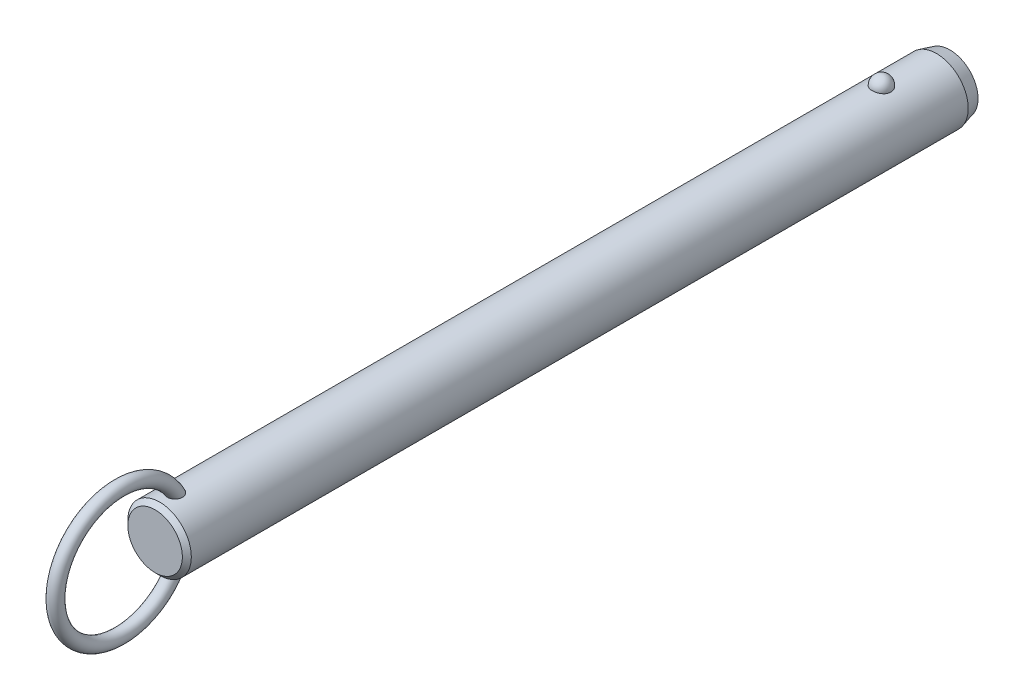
ISO-10303-21;
HEADER;
FILE_DESCRIPTION(('STEP AP214'),'2;1');
FILE_NAME('part.step','',(''),(''),'','','');
FILE_SCHEMA(('AUTOMOTIVE_DESIGN { 1 0 10303 214 1 1 1 1 }'));
ENDSEC;
DATA;
#1=APPLICATION_CONTEXT('core data for automotive mechanical design processes');
#2=APPLICATION_PROTOCOL_DEFINITION('international standard','automotive_design',2000,#1);
#3=PRODUCT_CONTEXT('',#1,'mechanical');
#4=PRODUCT('Part','Part','',(#3));
#5=PRODUCT_RELATED_PRODUCT_CATEGORY('part','',(#4));
#6=PRODUCT_DEFINITION_FORMATION('','',#4);
#7=PRODUCT_DEFINITION_CONTEXT('part definition',#1,'design');
#8=PRODUCT_DEFINITION('design','',#6,#7);
#9=PRODUCT_DEFINITION_SHAPE('','',#8);
#10=(LENGTH_UNIT() NAMED_UNIT(*) SI_UNIT(.MILLI.,.METRE.));
#11=(NAMED_UNIT(*) PLANE_ANGLE_UNIT() SI_UNIT($,.RADIAN.));
#12=(NAMED_UNIT(*) SI_UNIT($,.STERADIAN.) SOLID_ANGLE_UNIT());
#13=UNCERTAINTY_MEASURE_WITH_UNIT(LENGTH_MEASURE(1.E-05),#10,'distance_accuracy_value','');
#14=(GEOMETRIC_REPRESENTATION_CONTEXT(3) GLOBAL_UNCERTAINTY_ASSIGNED_CONTEXT((#13)) GLOBAL_UNIT_ASSIGNED_CONTEXT((#10,
#11,#12)) REPRESENTATION_CONTEXT('',''));
#15=CARTESIAN_POINT('',(0.,0.,0.));
#16=DIRECTION('',(0.,0.,1.));
#17=DIRECTION('',(1.,0.,0.));
#18=AXIS2_PLACEMENT_3D('',#15,#16,#17);
#19=CARTESIAN_POINT('',(0.,0.,152.4));
#20=DIRECTION('',(0.,0.,-1.));
#21=DIRECTION('',(-1.,0.,0.));
#22=AXIS2_PLACEMENT_3D('',#19,#20,#21);
#23=CYLINDRICAL_SURFACE('',#22,7.1);
#24=CARTESIAN_POINT('',(2.0769088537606,6.78943661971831,-2.10000000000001));
#25=CARTESIAN_POINT('',(2.07690739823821,6.78943796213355,-1.98268154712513));
#26=CARTESIAN_POINT('',(2.06738130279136,6.79237331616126,-1.86534506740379));
#27=CARTESIAN_POINT('',(2.0295040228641,6.8037853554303,-1.63400788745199));
#28=CARTESIAN_POINT('',(2.00114757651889,6.81226358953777,-1.52000812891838));
#29=CARTESIAN_POINT('',(1.92632025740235,6.83379798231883,-1.29863433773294));
#30=CARTESIAN_POINT('',(1.87985726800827,6.84685214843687,-1.19125744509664));
#31=CARTESIAN_POINT('',(1.76995205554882,6.87608091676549,-0.986046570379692));
#32=CARTESIAN_POINT('',(1.70650980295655,6.8922555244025,-0.888212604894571));
#33=CARTESIAN_POINT('',(1.56381192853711,6.92602930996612,-0.704242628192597));
#34=CARTESIAN_POINT('',(1.4844714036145,6.94363582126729,-0.618173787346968));
#35=CARTESIAN_POINT('',(1.31221746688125,6.97823658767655,-0.460740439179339));
#36=CARTESIAN_POINT('',(1.21930409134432,6.99523084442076,-0.389375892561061));
#37=CARTESIAN_POINT('',(1.02268781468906,7.02666176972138,-0.263547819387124));
#38=CARTESIAN_POINT('',(0.919020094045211,7.04110638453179,-0.209031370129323));
#39=CARTESIAN_POINT('',(0.703548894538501,7.06588726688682,-0.118163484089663));
#40=CARTESIAN_POINT('',(0.591746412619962,7.07622403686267,-0.0818098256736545));
#41=CARTESIAN_POINT('',(0.365557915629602,7.09147068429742,-0.0288711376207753));
#42=CARTESIAN_POINT('',(0.251267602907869,7.09648447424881,-0.011907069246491));
#43=CARTESIAN_POINT('',(0.0213499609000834,7.10089837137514,0.00304925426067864));
#44=CARTESIAN_POINT('',(-0.0942772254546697,7.10029907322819,0.00104351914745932));
#45=CARTESIAN_POINT('',(-0.3216515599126,7.09360829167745,-0.0216931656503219));
#46=CARTESIAN_POINT('',(-0.433431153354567,7.08760388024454,-0.0421272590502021));
#47=CARTESIAN_POINT('',(-0.651862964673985,7.07086131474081,-0.100729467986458));
#48=CARTESIAN_POINT('',(-0.758515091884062,7.06012307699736,-0.13889789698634));
#49=CARTESIAN_POINT('',(-0.964449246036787,7.03496097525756,-0.232213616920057));
#50=CARTESIAN_POINT('',(-1.06368095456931,7.02051445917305,-0.287465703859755));
#51=CARTESIAN_POINT('',(-1.25145353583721,6.98948740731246,-0.413383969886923));
#52=CARTESIAN_POINT('',(-1.33999321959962,6.97290663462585,-0.484051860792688));
#53=CARTESIAN_POINT('',(-1.50591604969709,6.93898770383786,-0.640594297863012));
#54=CARTESIAN_POINT('',(-1.58302488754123,6.92164094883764,-0.726757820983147));
#55=CARTESIAN_POINT('',(-1.72189320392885,6.8884103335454,-0.910927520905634));
#56=CARTESIAN_POINT('',(-1.78365144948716,6.87252659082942,-1.00893464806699));
#57=CARTESIAN_POINT('',(-1.89101272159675,6.84377189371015,-1.21549497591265));
#58=CARTESIAN_POINT('',(-1.93639553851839,6.83094274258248,-1.32416860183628));
#59=CARTESIAN_POINT('',(-2.00874275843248,6.81002070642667,-1.54791500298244));
#60=CARTESIAN_POINT('',(-2.03570774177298,6.80192767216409,-1.66298757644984));
#61=CARTESIAN_POINT('',(-2.07047276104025,6.7914266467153,-1.89571453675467));
#62=CARTESIAN_POINT('',(-2.07835878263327,6.78899315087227,-2.01335491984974));
#63=CARTESIAN_POINT('',(-2.07502083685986,6.79001409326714,-2.24833570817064));
#64=CARTESIAN_POINT('',(-2.06379746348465,6.7934683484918,-2.36567612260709));
#65=CARTESIAN_POINT('',(-2.02263913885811,6.80583442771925,-2.59603194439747));
#66=CARTESIAN_POINT('',(-1.99281127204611,6.81471501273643,-2.70906820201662));
#67=CARTESIAN_POINT('',(-1.91526639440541,6.83691232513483,-2.92836575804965));
#68=CARTESIAN_POINT('',(-1.8675486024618,6.85022924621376,-3.03462676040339));
#69=CARTESIAN_POINT('',(-1.75504492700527,6.87991336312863,-3.23806487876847));
#70=CARTESIAN_POINT('',(-1.69015924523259,6.89629822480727,-3.33518422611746));
#71=CARTESIAN_POINT('',(-1.54505404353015,6.93024852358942,-3.51697105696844));
#72=CARTESIAN_POINT('',(-1.46483385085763,6.94781401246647,-3.60163799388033));
#73=CARTESIAN_POINT('',(-1.29071406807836,6.98225977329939,-3.75654119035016));
#74=CARTESIAN_POINT('',(-1.19675650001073,6.99913673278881,-3.82671308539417));
#75=CARTESIAN_POINT('',(-0.997940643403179,7.03023618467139,-3.9501837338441));
#76=CARTESIAN_POINT('',(-0.893083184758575,7.04445887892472,-4.00348377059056));
#77=CARTESIAN_POINT('',(-0.676902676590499,7.06848365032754,-4.09107242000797));
#78=CARTESIAN_POINT('',(-0.565686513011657,7.0783430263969,-4.12560889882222));
#79=CARTESIAN_POINT('',(-0.338739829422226,7.09282534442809,-4.17575450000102));
#80=CARTESIAN_POINT('',(-0.2230099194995,7.09744899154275,-4.19136617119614));
#81=CARTESIAN_POINT('',(0.00707628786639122,7.10090930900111,-4.20307965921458));
#82=CARTESIAN_POINT('',(0.121410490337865,7.09986531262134,-4.19958377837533));
#83=CARTESIAN_POINT('',(0.34781544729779,7.092380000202,-4.17411564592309));
#84=CARTESIAN_POINT('',(0.459886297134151,7.08593891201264,-4.15214417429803));
#85=CARTESIAN_POINT('',(0.67808462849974,7.06838983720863,-4.09049562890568));
#86=CARTESIAN_POINT('',(0.784237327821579,7.05730369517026,-4.05090137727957));
#87=CARTESIAN_POINT('',(0.988305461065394,7.03163139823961,-3.95511447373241));
#88=CARTESIAN_POINT('',(1.08622031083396,7.01704499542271,-3.89892064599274));
#89=CARTESIAN_POINT('',(1.27284490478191,6.98562668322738,-3.77035541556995));
#90=CARTESIAN_POINT('',(1.36137372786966,6.96876135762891,-3.69772964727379));
#91=CARTESIAN_POINT('',(1.52509486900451,6.93477412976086,-3.53878279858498));
#92=CARTESIAN_POINT('',(1.60028496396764,6.91765218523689,-3.45245943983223));
#93=CARTESIAN_POINT('',(1.73681688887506,6.88465753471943,-3.26658774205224));
#94=CARTESIAN_POINT('',(1.79785966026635,6.86881574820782,-3.16681408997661));
#95=CARTESIAN_POINT('',(1.90265327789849,6.84053157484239,-2.95814408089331));
#96=CARTESIAN_POINT('',(1.94640861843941,6.82808830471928,-2.84925010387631));
#97=CARTESIAN_POINT('',(2.01274378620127,6.80881460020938,-2.63454318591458));
#98=CARTESIAN_POINT('',(2.03676193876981,6.80160856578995,-2.52920574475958));
#99=CARTESIAN_POINT('',(2.06884490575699,6.79191902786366,-2.3159172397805));
#100=CARTESIAN_POINT('',(2.07691019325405,6.78943538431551,-2.20796625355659));
#101=CARTESIAN_POINT('',(2.0769088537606,6.78943661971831,-2.10000000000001));
#102=B_SPLINE_CURVE_WITH_KNOTS('',3,(#24,#25,#26,#27,#28,#29,#30,#31,#32,#33,#34,#35,#36,#37,
#38,#39,#40,#41,#42,#43,#44,#45,#46,#47,#48,#49,#50,#51,#52,#53,#54,#55,#56,#57,#58,#59,#60,#61,
#62,#63,#64,#65,#66,#67,#68,#69,#70,#71,#72,#73,#74,#75,#76,#77,#78,#79,#80,#81,#82,#83,#84,#85,
#86,#87,#88,#89,#90,#91,#92,#93,#94,#95,#96,#97,#98,#99,#100,#101),.UNSPECIFIED.,.T.,.F.,(4,2,2,
2,2,2,2,2,2,2,2,2,2,2,2,2,2,2,2,2,2,2,2,2,2,2,2,2,2,2,2,2,2,2,2,2,2,2,4),(0.,0.351568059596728,
0.703234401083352,1.05474780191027,1.40626181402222,1.75970563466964,2.11314851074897,
2.46546960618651,2.81774759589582,3.16301449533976,3.50824481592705,3.84801136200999,
4.18778391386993,4.52968352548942,4.87162112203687,5.22076181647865,5.56993054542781,
5.92363364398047,6.27732559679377,6.62942052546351,6.98150450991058,7.33158042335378,
7.68167162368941,8.03384443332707,8.38603269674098,8.73975272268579,9.09344583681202,
9.44234545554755,9.79119807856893,10.1327344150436,10.4742563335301,10.8141898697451,
11.1541474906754,11.4997793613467,11.8454687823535,12.1979079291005,12.5502553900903,
12.8738073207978,13.1973496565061),.UNSPECIFIED.);
#103=CARTESIAN_POINT('',(2.0769088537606,6.78943661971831,-2.10000000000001));
#104=VERTEX_POINT('',#103);
#105=EDGE_CURVE('E41',#104,#104,#102,.T.);
#106=ORIENTED_EDGE('',*,*,#105,.T.);
#107=EDGE_LOOP('',(#106));
#108=FACE_BOUND('',#107,.T.);
#109=CARTESIAN_POINT('',(0.,0.,159.32));
#110=DIRECTION('',(0.,0.,1.));
#111=DIRECTION('',(1.,0.,0.));
#112=AXIS2_PLACEMENT_3D('',#109,#110,#111);
#113=CIRCLE('',#112,7.1);
#114=CARTESIAN_POINT('',(7.1,0.,159.32));
#115=VERTEX_POINT('',#114);
#116=EDGE_CURVE('E10',#115,#115,#113,.F.);
#117=ORIENTED_EDGE('',*,*,#116,.T.);
#118=EDGE_LOOP('',(#117));
#119=FACE_BOUND('',#118,.T.);
#120=CARTESIAN_POINT('',(-0.429539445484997,-7.08699541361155,154.142921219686));
#121=CARTESIAN_POINT('',(-0.508331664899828,-7.08221999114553,154.166876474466));
#122=CARTESIAN_POINT('',(-0.585039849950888,-7.07624016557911,154.197457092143));
#123=CARTESIAN_POINT('',(-0.73208265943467,-7.06254296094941,154.271024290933));
#124=CARTESIAN_POINT('',(-0.802417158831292,-7.05482554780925,154.314011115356));
#125=CARTESIAN_POINT('',(-0.934722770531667,-7.03851844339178,154.411113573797));
#126=CARTESIAN_POINT('',(-0.996700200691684,-7.02992941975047,154.465220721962));
#127=CARTESIAN_POINT('',(-1.11079942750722,-7.01280697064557,154.582967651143));
#128=CARTESIAN_POINT('',(-1.16292136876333,-7.00427354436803,154.646607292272));
#129=CARTESIAN_POINT('',(-1.25705660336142,-6.98799959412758,154.782687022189));
#130=CARTESIAN_POINT('',(-1.29888032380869,-6.98027525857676,154.855259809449));
#131=CARTESIAN_POINT('',(-1.37069920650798,-6.96652886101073,155.006168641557));
#132=CARTESIAN_POINT('',(-1.40069157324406,-6.96050720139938,155.084506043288));
#133=CARTESIAN_POINT('',(-1.45043507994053,-6.95031881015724,155.250190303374));
#134=CARTESIAN_POINT('',(-1.46937115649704,-6.94630231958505,155.337789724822));
#135=CARTESIAN_POINT('',(-1.49424917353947,-6.94099239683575,155.514871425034));
#136=CARTESIAN_POINT('',(-1.50018601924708,-6.93970003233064,155.604354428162));
#137=CARTESIAN_POINT('',(-1.49978214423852,-6.93978815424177,155.794060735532));
#138=CARTESIAN_POINT('',(-1.49187639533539,-6.94150934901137,155.894279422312));
#139=CARTESIAN_POINT('',(-1.46177925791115,-6.94790814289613,156.092479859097));
#140=CARTESIAN_POINT('',(-1.43957541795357,-6.95258831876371,156.190459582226));
#141=CARTESIAN_POINT('',(-1.37783293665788,-6.96510647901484,156.39536292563));
#142=CARTESIAN_POINT('',(-1.33634073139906,-6.97328848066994,156.501680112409));
#143=CARTESIAN_POINT('',(-1.23686994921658,-6.99161706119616,156.706177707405));
#144=CARTESIAN_POINT('',(-1.17889192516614,-7.00176357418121,156.804358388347));
#145=CARTESIAN_POINT('',(-1.05875124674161,-7.02082898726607,156.972374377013));
#146=CARTESIAN_POINT('',(-0.999247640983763,-7.02963746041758,157.044123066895));
#147=CARTESIAN_POINT('',(-0.869494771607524,-7.04686074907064,157.177195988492));
#148=CARTESIAN_POINT('',(-0.799263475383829,-7.05527619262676,157.238537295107));
#149=CARTESIAN_POINT('',(-0.665408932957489,-7.06899457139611,157.335131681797));
#150=CARTESIAN_POINT('',(-0.603817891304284,-7.07457275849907,157.373151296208));
#151=CARTESIAN_POINT('',(-0.475172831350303,-7.08437420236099,157.438758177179));
#152=CARTESIAN_POINT('',(-0.408123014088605,-7.08859848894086,157.466353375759));
#153=CARTESIAN_POINT('',(-0.26943193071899,-7.09522749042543,157.509256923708));
#154=CARTESIAN_POINT('',(-0.19775731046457,-7.09761688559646,157.524461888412));
#155=CARTESIAN_POINT('',(-0.0527849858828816,-7.10017268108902,157.540716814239));
#156=CARTESIAN_POINT('',(0.0205115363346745,-7.10034065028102,157.541776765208));
#157=CARTESIAN_POINT('',(0.156426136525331,-7.09855986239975,157.530461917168));
#158=CARTESIAN_POINT('',(0.219199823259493,-7.09688191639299,157.519806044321));
#159=CARTESIAN_POINT('',(0.342134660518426,-7.09201880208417,157.488537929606));
#160=CARTESIAN_POINT('',(0.40229529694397,-7.08883333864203,157.467923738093));
#161=CARTESIAN_POINT('',(0.520687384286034,-7.08113868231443,157.417212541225));
#162=CARTESIAN_POINT('',(0.578791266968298,-7.07658958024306,157.386827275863));
#163=CARTESIAN_POINT('',(0.69017323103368,-7.06659708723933,157.318367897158));
#164=CARTESIAN_POINT('',(0.743447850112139,-7.061153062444,157.280288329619));
#165=CARTESIAN_POINT('',(0.870947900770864,-7.04680292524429,157.176592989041));
#166=CARTESIAN_POINT('',(0.941828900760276,-7.03755800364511,157.106897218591));
#167=CARTESIAN_POINT('',(1.07136606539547,-7.01900793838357,156.956945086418));
#168=CARTESIAN_POINT('',(1.13000013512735,-7.00970271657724,156.876670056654));
#169=CARTESIAN_POINT('',(1.23579584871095,-6.99183327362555,156.706899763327));
#170=CARTESIAN_POINT('',(1.28274271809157,-6.98328455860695,156.617269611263));
#171=CARTESIAN_POINT('',(1.3635144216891,-6.96796352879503,156.432176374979));
#172=CARTESIAN_POINT('',(1.39733971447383,-6.96119115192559,156.336713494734));
#173=CARTESIAN_POINT('',(1.45579181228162,-6.94922464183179,156.12530928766));
#174=CARTESIAN_POINT('',(1.47790145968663,-6.94449000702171,156.008631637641));
#175=CARTESIAN_POINT('',(1.50168752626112,-6.93938731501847,155.773015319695));
#176=CARTESIAN_POINT('',(1.50336085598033,-6.93901991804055,155.65407631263));
#177=CARTESIAN_POINT('',(1.48486516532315,-6.9430010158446,155.42360799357));
#178=CARTESIAN_POINT('',(1.46573441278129,-6.9471253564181,155.311995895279));
#179=CARTESIAN_POINT('',(1.40606892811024,-6.95944667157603,155.094886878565));
#180=CARTESIAN_POINT('',(1.36556446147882,-6.96763788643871,154.9893815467));
#181=CARTESIAN_POINT('',(1.2708270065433,-6.98548038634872,154.804287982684));
#182=CARTESIAN_POINT('',(1.21949810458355,-6.99473841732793,154.723171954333));
#183=CARTESIAN_POINT('',(1.10242050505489,-7.0141406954,154.572227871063));
#184=CARTESIAN_POINT('',(1.03668119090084,-7.02428436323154,154.50239252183));
#185=CARTESIAN_POINT('',(0.900559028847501,-7.04295285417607,154.383573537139));
#186=CARTESIAN_POINT('',(0.831428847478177,-7.05153466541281,154.333157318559));
#187=CARTESIAN_POINT('',(0.685291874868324,-7.06723150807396,154.245142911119));
#188=CARTESIAN_POINT('',(0.608287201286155,-7.07434693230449,154.207541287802));
#189=CARTESIAN_POINT('',(0.451878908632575,-7.08602232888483,154.147491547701));
#190=CARTESIAN_POINT('',(0.372686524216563,-7.09067127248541,154.124508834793));
#191=CARTESIAN_POINT('',(0.211477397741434,-7.09730788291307,154.092035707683));
#192=CARTESIAN_POINT('',(0.129460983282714,-7.09929585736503,154.08254373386));
#193=CARTESIAN_POINT('',(-0.0332905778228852,-7.10037858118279,154.077351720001));
#194=CARTESIAN_POINT('',(-0.114016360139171,-7.09953334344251,154.081365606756));
#195=CARTESIAN_POINT('',(-0.273670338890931,-7.09517338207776,154.102454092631));
#196=CARTESIAN_POINT('',(-0.352598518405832,-7.09165863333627,154.119528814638));
#197=CARTESIAN_POINT('',(-0.429539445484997,-7.08699541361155,154.142921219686));
#198=B_SPLINE_CURVE_WITH_KNOTS('',3,(#120,#121,#122,#123,#124,#125,#126,#127,#128,#129,#130,
#131,#132,#133,#134,#135,#136,#137,#138,#139,#140,#141,#142,#143,#144,#145,#146,#147,#148,#149,
#150,#151,#152,#153,#154,#155,#156,#157,#158,#159,#160,#161,#162,#163,#164,#165,#166,#167,#168,
#169,#170,#171,#172,#173,#174,#175,#176,#177,#178,#179,#180,#181,#182,#183,#184,#185,#186,#187,
#188,#189,#190,#191,#192,#193,#194,#195,#196,#197),.UNSPECIFIED.,.T.,.F.,(4,2,2,2,2,2,2,2,2,2,2,
2,2,2,2,2,2,2,2,2,2,2,2,2,2,2,2,2,2,2,2,2,2,2,2,2,2,2,4),(0.,0.247183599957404,
0.494372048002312,0.741372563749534,0.988369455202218,1.23962059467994,1.490931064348,
1.75897818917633,2.02713035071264,2.3275826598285,2.62829697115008,2.97008736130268,
3.31186629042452,3.59175319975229,3.87117637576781,4.08813841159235,4.30493502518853,
4.5235225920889,4.74195577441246,4.93215328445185,5.12238804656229,5.31884850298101,
5.51544871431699,5.81332317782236,6.11173048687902,6.41527266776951,6.71880423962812,
7.07358156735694,7.42841252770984,7.76631485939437,8.10373999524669,8.39142246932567,
8.67891817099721,8.93560332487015,9.19221962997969,9.43881106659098,9.68537399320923,
9.92674752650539,10.1681233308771),.UNSPECIFIED.);
#199=CARTESIAN_POINT('',(-0.429539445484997,-7.08699541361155,154.142921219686));
#200=VERTEX_POINT('',#199);
#201=EDGE_CURVE('E59',#200,#200,#198,.T.);
#202=ORIENTED_EDGE('',*,*,#201,.T.);
#203=EDGE_LOOP('',(#202));
#204=FACE_BOUND('',#203,.T.);
#205=CARTESIAN_POINT('',(-0.429539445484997,7.08699541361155,154.142921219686));
#206=CARTESIAN_POINT('',(-0.351665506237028,7.09171429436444,154.119246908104));
#207=CARTESIAN_POINT('',(-0.271733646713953,7.09525896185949,154.102036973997));
#208=CARTESIAN_POINT('',(-0.110026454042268,7.09960839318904,154.081005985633));
#209=CARTESIAN_POINT('',(-0.0282502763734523,7.10041187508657,154.077191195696));
#210=CARTESIAN_POINT('',(0.134782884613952,7.09918849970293,154.083059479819));
#211=CARTESIAN_POINT('',(0.216039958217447,7.09716214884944,154.09274013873));
#212=CARTESIAN_POINT('',(0.375730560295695,7.09050177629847,154.125347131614));
#213=CARTESIAN_POINT('',(0.454164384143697,7.08586802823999,154.148272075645));
#214=CARTESIAN_POINT('',(0.606025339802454,7.07449911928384,154.206771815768));
#215=CARTESIAN_POINT('',(0.67945100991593,7.06776334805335,154.242350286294));
#216=CARTESIAN_POINT('',(0.819234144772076,7.05292866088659,154.325175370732));
#217=CARTESIAN_POINT('',(0.88559181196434,7.04482978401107,154.372421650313));
#218=CARTESIAN_POINT('',(1.00993211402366,7.02808709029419,154.477590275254));
#219=CARTESIAN_POINT('',(1.06785399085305,7.01943990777,154.535583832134));
#220=CARTESIAN_POINT('',(1.17342527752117,7.00256662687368,154.660301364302));
#221=CARTESIAN_POINT('',(1.22107408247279,6.99434055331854,154.727025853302));
#222=CARTESIAN_POINT('',(1.30652927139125,6.97889183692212,154.869362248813));
#223=CARTESIAN_POINT('',(1.34399711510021,6.97170674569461,154.945180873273));
#224=CARTESIAN_POINT('',(1.40682616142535,6.95930080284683,155.101810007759));
#225=CARTESIAN_POINT('',(1.43218374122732,6.95408053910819,155.18262200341));
#226=CARTESIAN_POINT('',(1.47246409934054,6.94566853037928,155.353531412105));
#227=CARTESIAN_POINT('',(1.48642590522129,6.9426653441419,155.44386307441));
#228=CARTESIAN_POINT('',(1.5011410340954,6.93949744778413,155.625619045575));
#229=CARTESIAN_POINT('',(1.50188917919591,6.93933385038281,155.717043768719));
#230=CARTESIAN_POINT('',(1.49030464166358,6.94183245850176,155.91084381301));
#231=CARTESIAN_POINT('',(1.47627413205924,6.94486147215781,156.013112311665));
#232=CARTESIAN_POINT('',(1.43356351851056,6.95380194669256,156.214471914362));
#233=CARTESIAN_POINT('',(1.4048676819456,6.95971650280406,156.313559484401));
#234=CARTESIAN_POINT('',(1.32908750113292,6.97461208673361,156.518908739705));
#235=CARTESIAN_POINT('',(1.28011435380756,6.98388945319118,156.624456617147));
#236=CARTESIAN_POINT('',(1.16520357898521,7.00397743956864,156.825760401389));
#237=CARTESIAN_POINT('',(1.09927694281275,7.01478706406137,156.921522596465));
#238=CARTESIAN_POINT('',(0.969361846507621,7.03373936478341,157.076756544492));
#239=CARTESIAN_POINT('',(0.909042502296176,7.04187023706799,157.139303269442));
#240=CARTESIAN_POINT('',(0.779178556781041,7.05741732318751,157.254053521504));
#241=CARTESIAN_POINT('',(0.709649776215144,7.06483472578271,157.306274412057));
#242=CARTESIAN_POINT('',(0.576854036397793,7.0767751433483,157.388113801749));
#243=CARTESIAN_POINT('',(0.515118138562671,7.08158033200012,157.420164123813));
#244=CARTESIAN_POINT('',(0.387127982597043,7.08972701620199,157.473765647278));
#245=CARTESIAN_POINT('',(0.320877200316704,7.09306962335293,157.495324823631));
#246=CARTESIAN_POINT('',(0.185041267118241,7.09791507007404,157.526400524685));
#247=CARTESIAN_POINT('',(0.115437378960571,7.09940591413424,157.535838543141));
#248=CARTESIAN_POINT('',(-0.0243157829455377,7.10030171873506,157.541522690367));
#249=CARTESIAN_POINT('',(-0.0944648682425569,7.0997073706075,157.537773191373));
#250=CARTESIAN_POINT('',(-0.225713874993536,7.09668414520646,157.518508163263));
#251=CARTESIAN_POINT('',(-0.287006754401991,7.09444865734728,157.504232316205));
#252=CARTESIAN_POINT('',(-0.406555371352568,7.08860360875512,157.466368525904));
#253=CARTESIAN_POINT('',(-0.464809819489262,7.08499346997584,157.442776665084));
#254=CARTESIAN_POINT('',(-0.594955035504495,7.07541654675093,157.378923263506));
#255=CARTESIAN_POINT('',(-0.665389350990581,7.06906574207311,157.335753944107));
#256=CARTESIAN_POINT('',(-0.798242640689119,7.05530261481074,157.238587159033));
#257=CARTESIAN_POINT('',(-0.860645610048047,7.0478882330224,157.184568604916));
#258=CARTESIAN_POINT('',(-0.99424943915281,7.03045217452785,157.050996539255));
#259=CARTESIAN_POINT('',(-1.06260129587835,7.02030745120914,156.968614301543));
#260=CARTESIAN_POINT('',(-1.18502045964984,7.00068382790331,156.793843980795));
#261=CARTESIAN_POINT('',(-1.23907684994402,6.99120544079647,156.701448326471));
#262=CARTESIAN_POINT('',(-1.33335589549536,6.97384343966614,156.508008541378));
#263=CARTESIAN_POINT('',(-1.37336138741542,6.96598557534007,156.406856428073));
#264=CARTESIAN_POINT('',(-1.43770677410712,6.95299053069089,156.199504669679));
#265=CARTESIAN_POINT('',(-1.46204473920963,6.94785368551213,156.09330440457));
#266=CARTESIAN_POINT('',(-1.49537533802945,6.94076296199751,155.868231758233));
#267=CARTESIAN_POINT('',(-1.50273564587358,6.93914842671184,155.74909751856));
#268=CARTESIAN_POINT('',(-1.4954555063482,6.94072368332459,155.511470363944));
#269=CARTESIAN_POINT('',(-1.48082914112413,6.94391040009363,155.392977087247));
#270=CARTESIAN_POINT('',(-1.43076401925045,6.95438579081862,155.173432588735));
#271=CARTESIAN_POINT('',(-1.39762227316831,6.96121852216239,155.071841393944));
#272=CARTESIAN_POINT('',(-1.31211274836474,6.97783941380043,154.877351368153));
#273=CARTESIAN_POINT('',(-1.25976607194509,6.98762432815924,154.78444313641));
#274=CARTESIAN_POINT('',(-1.14583073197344,7.00713153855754,154.624160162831));
#275=CARTESIAN_POINT('',(-1.08665947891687,7.01665982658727,154.555035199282));
#276=CARTESIAN_POINT('',(-0.95660664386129,7.03556646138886,154.428878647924));
#277=CARTESIAN_POINT('',(-0.88573712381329,7.04494495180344,154.371834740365));
#278=CARTESIAN_POINT('',(-0.751558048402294,7.06035735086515,154.283100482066));
#279=CARTESIAN_POINT('',(-0.690120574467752,7.0666695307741,154.248593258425));
#280=CARTESIAN_POINT('',(-0.562815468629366,7.07794609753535,154.188750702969));
#281=CARTESIAN_POINT('',(-0.496948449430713,7.08291067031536,154.163414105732));
#282=CARTESIAN_POINT('',(-0.429539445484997,7.08699541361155,154.142921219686));
#283=B_SPLINE_CURVE_WITH_KNOTS('',3,(#205,#206,#207,#208,#209,#210,#211,#212,#213,#214,#215,
#216,#217,#218,#219,#220,#221,#222,#223,#224,#225,#226,#227,#228,#229,#230,#231,#232,#233,#234,
#235,#236,#237,#238,#239,#240,#241,#242,#243,#244,#245,#246,#247,#248,#249,#250,#251,#252,#253,
#254,#255,#256,#257,#258,#259,#260,#261,#262,#263,#264,#265,#266,#267,#268,#269,#270,#271,#272,
#273,#274,#275,#276,#277,#278,#279,#280,#281,#282),.UNSPECIFIED.,.T.,.F.,(4,2,2,2,2,2,2,2,2,2,2,
2,2,2,2,2,2,2,2,2,2,2,2,2,2,2,2,2,2,2,2,2,2,2,2,2,2,2,4),(0.,0.244335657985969,
0.488785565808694,0.733191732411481,0.977572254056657,1.2220237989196,1.46646834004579,
1.71259457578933,1.9587352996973,2.21226768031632,2.46587585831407,2.73913816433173,
3.01250754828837,3.32109936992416,3.63002293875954,3.9786351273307,4.32702187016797,
4.58793945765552,4.84841449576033,5.05676704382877,5.26496096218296,5.47449661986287,
5.68396281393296,5.87205447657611,6.06022532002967,6.30743751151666,6.55513496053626,
6.87602468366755,7.19715875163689,7.52305774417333,7.84899686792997,8.20516155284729,
8.56109821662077,8.88040084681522,9.19935367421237,9.47236282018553,9.74509220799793,
9.95662250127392,10.1681235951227),.UNSPECIFIED.);
#284=CARTESIAN_POINT('',(-0.429539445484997,7.08699541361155,154.142921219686));
#285=VERTEX_POINT('',#284);
#286=EDGE_CURVE('E67',#285,#285,#283,.T.);
#287=ORIENTED_EDGE('',*,*,#286,.T.);
#288=EDGE_LOOP('',(#287));
#289=FACE_BOUND('',#288,.T.);
#290=CARTESIAN_POINT('',(0.,0.,-14.4000000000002));
#291=DIRECTION('',(0.,0.,-1.));
#292=DIRECTION('',(-1.,0.,0.));
#293=AXIS2_PLACEMENT_3D('',#290,#291,#292);
#294=CIRCLE('',#293,7.1);
#295=CARTESIAN_POINT('',(-7.1,0.,-14.4000000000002));
#296=VERTEX_POINT('',#295);
#297=EDGE_CURVE('E56',#296,#296,#294,.F.);
#298=ORIENTED_EDGE('',*,*,#297,.T.);
#299=EDGE_LOOP('',(#298));
#300=FACE_BOUND('',#299,.T.);
#301=ADVANCED_FACE('F37',(#108,#119,#204,#289,#300),#23,.T.);
#302=CARTESIAN_POINT('',(0.,0.,-17.4));
#303=DIRECTION('',(0.,0.,-1.));
#304=DIRECTION('',(-1.,0.,0.));
#305=AXIS2_PLACEMENT_3D('',#302,#303,#304);
#306=PLANE('',#305);
#307=CARTESIAN_POINT('',(0.,0.,-17.4));
#308=DIRECTION('',(0.,0.,-1.));
#309=DIRECTION('',(-1.,0.,0.));
#310=AXIS2_PLACEMENT_3D('',#307,#308,#309);
#311=CIRCLE('',#310,6.29615242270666);
#312=CARTESIAN_POINT('',(-6.29615242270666,0.,-17.4));
#313=VERTEX_POINT('',#312);
#314=EDGE_CURVE('E66',#313,#313,#311,.T.);
#315=ORIENTED_EDGE('',*,*,#314,.T.);
#316=EDGE_LOOP('',(#315));
#317=FACE_BOUND('',#316,.T.);
#318=ADVANCED_FACE('F85',(#317),#306,.T.);
#319=CARTESIAN_POINT('',(0.,0.,-17.4));
#320=DIRECTION('',(0.,0.,1.));
#321=DIRECTION('',(1.,0.,0.));
#322=AXIS2_PLACEMENT_3D('',#319,#320,#321);
#323=CONICAL_SURFACE('',#322,6.29615242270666,0.261799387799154);
#324=ORIENTED_EDGE('',*,*,#297,.F.);
#325=EDGE_LOOP('',(#324));
#326=FACE_BOUND('',#325,.T.);
#327=ORIENTED_EDGE('',*,*,#314,.F.);
#328=EDGE_LOOP('',(#327));
#329=FACE_BOUND('',#328,.T.);
#330=ADVANCED_FACE('F83',(#326,#329),#323,.T.);
#331=CARTESIAN_POINT('',(0.,0.,160.32));
#332=DIRECTION('',(0.,0.,1.));
#333=DIRECTION('',(1.,0.,0.));
#334=AXIS2_PLACEMENT_3D('',#331,#332,#333);
#335=PLANE('',#334);
#336=CARTESIAN_POINT('',(0.,0.,160.32));
#337=DIRECTION('',(0.,0.,1.));
#338=DIRECTION('',(1.,0.,0.));
#339=AXIS2_PLACEMENT_3D('',#336,#337,#338);
#340=CIRCLE('',#339,6.10000000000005);
#341=CARTESIAN_POINT('',(6.10000000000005,0.,160.32));
#342=VERTEX_POINT('',#341);
#343=EDGE_CURVE('E50',#342,#342,#340,.T.);
#344=ORIENTED_EDGE('',*,*,#343,.T.);
#345=EDGE_LOOP('',(#344));
#346=FACE_BOUND('',#345,.T.);
#347=ADVANCED_FACE('F77',(#346),#335,.T.);
#348=CARTESIAN_POINT('',(0.,0.,168.25));
#349=DIRECTION('',(1.,0.,0.));
#350=DIRECTION('',(0.,0.,-1.));
#351=AXIS2_PLACEMENT_3D('',#348,#349,#350);
#352=TOROIDAL_SURFACE('',#351,14.35,1.5);
#353=ORIENTED_EDGE('',*,*,#286,.F.);
#354=EDGE_LOOP('',(#353));
#355=FACE_BOUND('',#354,.T.);
#356=ORIENTED_EDGE('',*,*,#201,.F.);
#357=EDGE_LOOP('',(#356));
#358=FACE_BOUND('',#357,.T.);
#359=ADVANCED_FACE('F73',(#355,#358),#352,.T.);
#360=CARTESIAN_POINT('',(0.,0.,160.32));
#361=DIRECTION('',(0.,0.,-1.));
#362=DIRECTION('',(-1.,0.,0.));
#363=AXIS2_PLACEMENT_3D('',#360,#361,#362);
#364=CONICAL_SURFACE('',#363,6.10000000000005,0.785398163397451);
#365=ORIENTED_EDGE('',*,*,#116,.F.);
#366=EDGE_LOOP('',(#365));
#367=FACE_BOUND('',#366,.T.);
#368=ORIENTED_EDGE('',*,*,#343,.F.);
#369=EDGE_LOOP('',(#368));
#370=FACE_BOUND('',#369,.T.);
#371=ADVANCED_FACE('F39',(#367,#370),#364,.T.);
#372=CARTESIAN_POINT('',(0.,7.1,-2.1));
#373=DIRECTION('',(0.,1.,0.));
#374=DIRECTION('',(0.,0.,1.));
#375=AXIS2_PLACEMENT_3D('',#372,#373,#374);
#376=SPHERICAL_SURFACE('',#375,2.10000000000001);
#377=ORIENTED_EDGE('',*,*,#105,.F.);
#378=EDGE_LOOP('',(#377));
#379=FACE_BOUND('',#378,.T.);
#380=ADVANCED_FACE('F79',(#379),#376,.T.);
#381=CLOSED_SHELL('',(#301,#318,#330,#347,#359,#371,#380));
#382=MANIFOLD_SOLID_BREP('B2',#381);
#383=ADVANCED_BREP_SHAPE_REPRESENTATION('',(#18,#382),#14);
#384=SHAPE_DEFINITION_REPRESENTATION(#9,#383);
ENDSEC;
END-ISO-10303-21;
